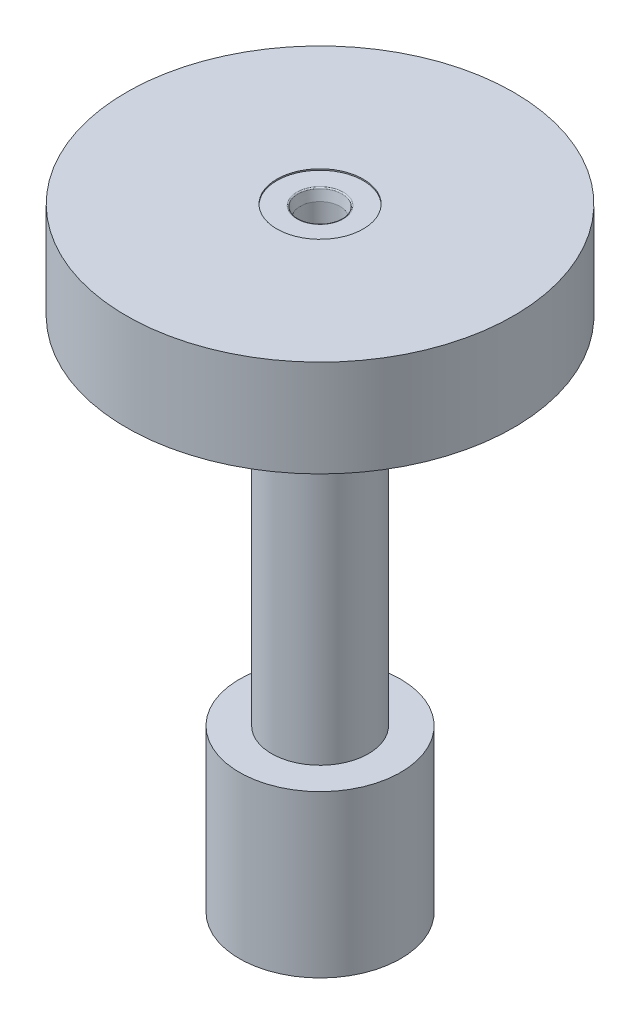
from build123d import *

# Parameters (mm, degrees)
SKETCH23_R         = 9.525
CUT_EXTRUDE5_DEPTH = 22.86


with BuildPart() as part:
    # Sketch2 → Revolve1 (revolve)
    with BuildSketch(Plane.XY, mode=Mode.PRIVATE) as revolve1_sk:
        Polygon((0, 0), (-38.1, 0), (-38.1, -19.05), (-9.525, -19.05), (-9.525, -88.9), (-15.875, -88.9), (-15.875, -120.65), (0, -120.65), (0, -19.05), align=None)
    revolve(revolve1_sk.sketch.rotate(Axis((0, 0, 0), (0, 1, 0)), 270), axis=Axis((0, 0, 0), (0, 1, 0)))

    # Port Sketch → SAE Port (revolve, cut)
    with BuildSketch(Plane(origin=(1.57790185, 0, 0.931432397), x_dir=(-0.8611569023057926, 0, -0.5083392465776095), z_dir=(-0.5083392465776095, 0, 0.8611569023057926)), mode=Mode.PRIVATE) as sae_port_sk:
        with BuildLine():
            Line((1.832304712, 114.3), (5.286704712, 112.224387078))
            Line((5.286704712, 112.224387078), (5.286704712, 10.254))
            Line((5.286704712, 10.254), (5.801054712, 10.254))
            Line((5.801054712, 10.254), (5.801054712, 2.308196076))
            Line((5.801054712, 2.308196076), (5.755250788, 2.354))
            Line((5.755250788, 2.354), (6.158855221, 0.455190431))
            ThreePointArc((6.158855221, 0.455190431), (6.247457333, 0.310604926), (6.407304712, 0.254))
            Line((6.407304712, 0.254), (10.332304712, 0.254))
            Line((10.332304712, 0.254), (10.332304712, 0))
            Line((10.332304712, 0), (1.832304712, 0))
            Line((1.832304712, 0), (1.832304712, 114.3))
        make_face()
    revolve(sae_port_sk.sketch.rotate(Axis((0, 0, 0), (0, -1, 0)), 239.446729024), axis=Axis((0, 0, 0), (0, -1, 0)), mode=Mode.SUBTRACT)

    # Sketch23 → Cut-Extrude5 (cut)
    with BuildSketch(Plane(origin=(0, 0, 0), x_dir=(0, 0, -1), z_dir=(1, 0, 0))):
        with Locations((0, -104.775)):
            Circle(SKETCH23_R)
    extrude(amount=-CUT_EXTRUDE5_DEPTH, mode=Mode.SUBTRACT)


solid = part.part
